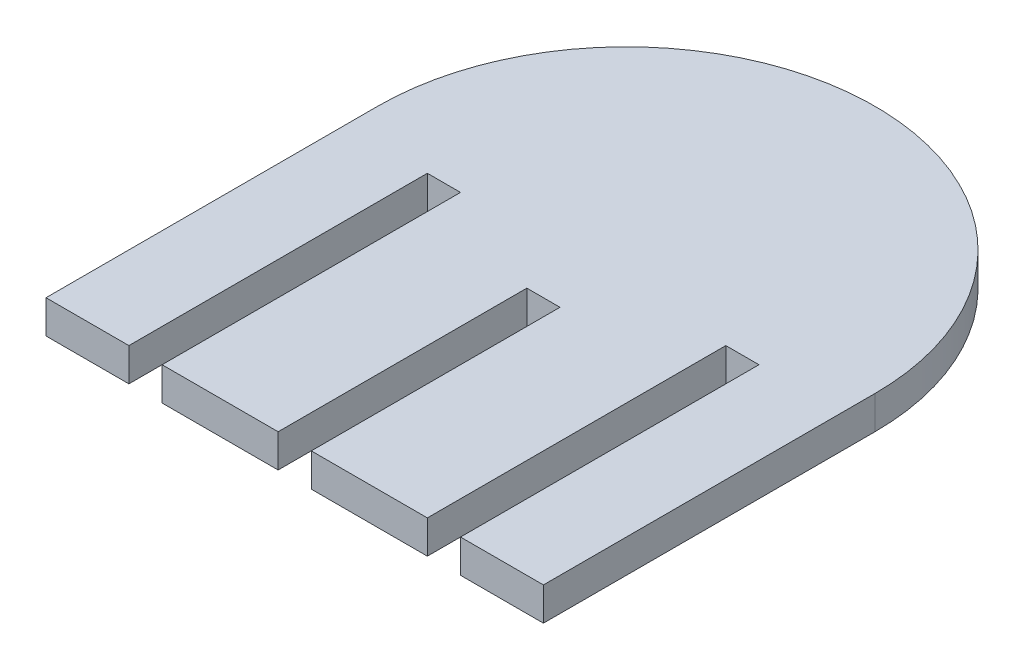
ISO-10303-21;
HEADER;
FILE_DESCRIPTION(('STEP AP214'),'2;1');
FILE_NAME('part.step','',(''),(''),'','','');
FILE_SCHEMA(('AUTOMOTIVE_DESIGN { 1 0 10303 214 1 1 1 1 }'));
ENDSEC;
DATA;
#1=APPLICATION_CONTEXT('core data for automotive mechanical design processes');
#2=APPLICATION_PROTOCOL_DEFINITION('international standard','automotive_design',2000,#1);
#3=PRODUCT_CONTEXT('',#1,'mechanical');
#4=PRODUCT('Part','Part','',(#3));
#5=PRODUCT_RELATED_PRODUCT_CATEGORY('part','',(#4));
#6=PRODUCT_DEFINITION_FORMATION('','',#4);
#7=PRODUCT_DEFINITION_CONTEXT('part definition',#1,'design');
#8=PRODUCT_DEFINITION('design','',#6,#7);
#9=PRODUCT_DEFINITION_SHAPE('','',#8);
#10=(LENGTH_UNIT() NAMED_UNIT(*) SI_UNIT(.MILLI.,.METRE.));
#11=(NAMED_UNIT(*) PLANE_ANGLE_UNIT() SI_UNIT($,.RADIAN.));
#12=(NAMED_UNIT(*) SI_UNIT($,.STERADIAN.) SOLID_ANGLE_UNIT());
#13=UNCERTAINTY_MEASURE_WITH_UNIT(LENGTH_MEASURE(1.E-05),#10,'distance_accuracy_value','');
#14=(GEOMETRIC_REPRESENTATION_CONTEXT(3) GLOBAL_UNCERTAINTY_ASSIGNED_CONTEXT((#13)) GLOBAL_UNIT_ASSIGNED_CONTEXT((#10,
#11,#12)) REPRESENTATION_CONTEXT('',''));
#15=CARTESIAN_POINT('',(0.,0.,0.));
#16=DIRECTION('',(0.,0.,1.));
#17=DIRECTION('',(1.,0.,0.));
#18=AXIS2_PLACEMENT_3D('',#15,#16,#17);
#19=CARTESIAN_POINT('',(-15.,2.,0.));
#20=DIRECTION('',(0.,0.,-1.));
#21=DIRECTION('',(-1.,0.,0.));
#22=AXIS2_PLACEMENT_3D('',#19,#20,#21);
#23=PLANE('',#22);
#24=DIRECTION('',(1.,0.,0.));
#25=VECTOR('',#24,1.);
#26=CARTESIAN_POINT('',(-15.,2.,0.));
#27=LINE('',#26,#25);
#28=CARTESIAN_POINT('',(0.999999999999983,1.99999999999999,0.));
#29=VERTEX_POINT('',#28);
#30=CARTESIAN_POINT('',(8.00000000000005,1.99999999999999,0.));
#31=VERTEX_POINT('',#30);
#32=EDGE_CURVE('E246',#29,#31,#27,.T.);
#33=ORIENTED_EDGE('',*,*,#32,.F.);
#34=DIRECTION('',(0.,1.,0.));
#35=VECTOR('',#34,1.);
#36=CARTESIAN_POINT('',(0.999999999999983,0.,0.));
#37=LINE('',#36,#35);
#38=CARTESIAN_POINT('',(0.999999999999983,0.,0.));
#39=VERTEX_POINT('',#38);
#40=EDGE_CURVE('E154',#39,#29,#37,.T.);
#41=ORIENTED_EDGE('',*,*,#40,.F.);
#42=DIRECTION('',(1.,0.,0.));
#43=VECTOR('',#42,1.);
#44=CARTESIAN_POINT('',(-15.,0.,0.));
#45=LINE('',#44,#43);
#46=CARTESIAN_POINT('',(8.00000000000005,0.,0.));
#47=VERTEX_POINT('',#46);
#48=EDGE_CURVE('E257',#39,#47,#45,.T.);
#49=ORIENTED_EDGE('',*,*,#48,.T.);
#50=DIRECTION('',(0.,-1.,0.));
#51=VECTOR('',#50,1.);
#52=CARTESIAN_POINT('',(8.00000000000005,0.,0.));
#53=LINE('',#52,#51);
#54=EDGE_CURVE('E193',#31,#47,#53,.T.);
#55=ORIENTED_EDGE('',*,*,#54,.F.);
#56=EDGE_LOOP('',(#33,#41,#49,#55));
#57=FACE_BOUND('',#56,.T.);
#58=ADVANCED_FACE('F35',(#57),#23,.F.);
#59=CARTESIAN_POINT('',(-8.00000000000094,0.,0.));
#60=VERTEX_POINT('',#59);
#61=CARTESIAN_POINT('',(-1.00000000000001,0.,0.));
#62=VERTEX_POINT('',#61);
#63=EDGE_CURVE('E256',#60,#62,#45,.T.);
#64=ORIENTED_EDGE('',*,*,#63,.T.);
#65=DIRECTION('',(0.,-1.,0.));
#66=VECTOR('',#65,1.);
#67=CARTESIAN_POINT('',(-1.00000000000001,0.,0.));
#68=LINE('',#67,#66);
#69=CARTESIAN_POINT('',(-1.00000000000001,1.99999999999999,0.));
#70=VERTEX_POINT('',#69);
#71=EDGE_CURVE('E166',#70,#62,#68,.T.);
#72=ORIENTED_EDGE('',*,*,#71,.F.);
#73=CARTESIAN_POINT('',(-8.00000000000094,2.,0.));
#74=VERTEX_POINT('',#73);
#75=EDGE_CURVE('E245',#74,#70,#27,.T.);
#76=ORIENTED_EDGE('',*,*,#75,.F.);
#77=DIRECTION('',(0.,1.,0.));
#78=VECTOR('',#77,1.);
#79=CARTESIAN_POINT('',(-8.00000000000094,0.,0.));
#80=LINE('',#79,#78);
#81=EDGE_CURVE('E178',#60,#74,#80,.T.);
#82=ORIENTED_EDGE('',*,*,#81,.F.);
#83=EDGE_LOOP('',(#64,#72,#76,#82));
#84=FACE_BOUND('',#83,.T.);
#85=ADVANCED_FACE('F297',(#84),#23,.F.);
#86=CARTESIAN_POINT('',(10.,1.99999999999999,0.));
#87=VERTEX_POINT('',#86);
#88=CARTESIAN_POINT('',(15.,2.,0.));
#89=VERTEX_POINT('',#88);
#90=EDGE_CURVE('E240',#87,#89,#27,.T.);
#91=ORIENTED_EDGE('',*,*,#90,.F.);
#92=DIRECTION('',(0.,1.,0.));
#93=VECTOR('',#92,1.);
#94=CARTESIAN_POINT('',(10.,0.,0.));
#95=LINE('',#94,#93);
#96=CARTESIAN_POINT('',(10.,0.,0.));
#97=VERTEX_POINT('',#96);
#98=EDGE_CURVE('E185',#97,#87,#95,.T.);
#99=ORIENTED_EDGE('',*,*,#98,.F.);
#100=CARTESIAN_POINT('',(15.,0.,0.));
#101=VERTEX_POINT('',#100);
#102=EDGE_CURVE('E253',#97,#101,#45,.T.);
#103=ORIENTED_EDGE('',*,*,#102,.T.);
#104=DIRECTION('',(0.,-1.,0.));
#105=VECTOR('',#104,1.);
#106=CARTESIAN_POINT('',(15.,2.,0.));
#107=LINE('',#106,#105);
#108=EDGE_CURVE('E244',#89,#101,#107,.T.);
#109=ORIENTED_EDGE('',*,*,#108,.F.);
#110=EDGE_LOOP('',(#91,#99,#103,#109));
#111=FACE_BOUND('',#110,.T.);
#112=ADVANCED_FACE('F317',(#111),#23,.F.);
#113=CARTESIAN_POINT('',(15.,2.,0.));
#114=DIRECTION('',(-1.,0.,0.));
#115=DIRECTION('',(0.,0.,1.));
#116=AXIS2_PLACEMENT_3D('',#113,#114,#115);
#117=PLANE('',#116);
#118=DIRECTION('',(0.,0.,-1.));
#119=VECTOR('',#118,1.);
#120=CARTESIAN_POINT('',(15.,0.,0.));
#121=LINE('',#120,#119);
#122=CARTESIAN_POINT('',(15.,0.,-20.));
#123=VERTEX_POINT('',#122);
#124=EDGE_CURVE('E201',#101,#123,#121,.T.);
#125=ORIENTED_EDGE('',*,*,#124,.T.);
#126=DIRECTION('',(0.,-1.,0.));
#127=VECTOR('',#126,1.);
#128=CARTESIAN_POINT('',(15.,2.,-20.));
#129=LINE('',#128,#127);
#130=CARTESIAN_POINT('',(15.,2.,-20.));
#131=VERTEX_POINT('',#130);
#132=EDGE_CURVE('E11',#131,#123,#129,.T.);
#133=ORIENTED_EDGE('',*,*,#132,.F.);
#134=DIRECTION('',(0.,0.,-1.));
#135=VECTOR('',#134,1.);
#136=CARTESIAN_POINT('',(15.,2.,0.));
#137=LINE('',#136,#135);
#138=EDGE_CURVE('E232',#89,#131,#137,.T.);
#139=ORIENTED_EDGE('',*,*,#138,.F.);
#140=ORIENTED_EDGE('',*,*,#108,.T.);
#141=EDGE_LOOP('',(#125,#133,#139,#140));
#142=FACE_BOUND('',#141,.T.);
#143=ADVANCED_FACE('F37',(#142),#117,.F.);
#144=CARTESIAN_POINT('',(0.,2.,-20.));
#145=DIRECTION('',(0.,-1.,0.));
#146=DIRECTION('',(0.,0.,-1.));
#147=AXIS2_PLACEMENT_3D('',#144,#145,#146);
#148=CYLINDRICAL_SURFACE('',#147,15.);
#149=CARTESIAN_POINT('',(0.,0.,-20.));
#150=DIRECTION('',(0.,1.,0.));
#151=DIRECTION('',(0.,0.,-1.));
#152=AXIS2_PLACEMENT_3D('',#149,#150,#151);
#153=CIRCLE('',#152,15.);
#154=CARTESIAN_POINT('',(-15.,0.,-20.));
#155=VERTEX_POINT('',#154);
#156=EDGE_CURVE('E249',#123,#155,#153,.T.);
#157=ORIENTED_EDGE('',*,*,#156,.T.);
#158=DIRECTION('',(0.,-1.,0.));
#159=VECTOR('',#158,1.);
#160=CARTESIAN_POINT('',(-15.,2.,-20.));
#161=LINE('',#160,#159);
#162=CARTESIAN_POINT('',(-15.,2.,-20.));
#163=VERTEX_POINT('',#162);
#164=EDGE_CURVE('E43',#163,#155,#161,.T.);
#165=ORIENTED_EDGE('',*,*,#164,.F.);
#166=CARTESIAN_POINT('',(0.,2.,-20.));
#167=DIRECTION('',(0.,1.,0.));
#168=DIRECTION('',(0.,0.,-1.));
#169=AXIS2_PLACEMENT_3D('',#166,#167,#168);
#170=CIRCLE('',#169,15.);
#171=EDGE_CURVE('E235',#131,#163,#170,.T.);
#172=ORIENTED_EDGE('',*,*,#171,.F.);
#173=ORIENTED_EDGE('',*,*,#132,.T.);
#174=EDGE_LOOP('',(#157,#165,#172,#173));
#175=FACE_BOUND('',#174,.T.);
#176=ADVANCED_FACE('F284',(#175),#148,.T.);
#177=CARTESIAN_POINT('',(-15.,2.,0.));
#178=DIRECTION('',(1.,0.,0.));
#179=DIRECTION('',(0.,0.,-1.));
#180=AXIS2_PLACEMENT_3D('',#177,#178,#179);
#181=PLANE('',#180);
#182=DIRECTION('',(0.,0.,1.));
#183=VECTOR('',#182,1.);
#184=CARTESIAN_POINT('',(-15.,0.,0.));
#185=LINE('',#184,#183);
#186=CARTESIAN_POINT('',(-15.,0.,0.));
#187=VERTEX_POINT('',#186);
#188=EDGE_CURVE('E251',#155,#187,#185,.T.);
#189=ORIENTED_EDGE('',*,*,#188,.T.);
#190=DIRECTION('',(0.,-1.,0.));
#191=VECTOR('',#190,1.);
#192=CARTESIAN_POINT('',(-15.,2.,0.));
#193=LINE('',#192,#191);
#194=CARTESIAN_POINT('',(-15.,2.,0.));
#195=VERTEX_POINT('',#194);
#196=EDGE_CURVE('E260',#195,#187,#193,.T.);
#197=ORIENTED_EDGE('',*,*,#196,.F.);
#198=DIRECTION('',(0.,0.,1.));
#199=VECTOR('',#198,1.);
#200=CARTESIAN_POINT('',(-15.,2.,0.));
#201=LINE('',#200,#199);
#202=EDGE_CURVE('E238',#163,#195,#201,.T.);
#203=ORIENTED_EDGE('',*,*,#202,.F.);
#204=ORIENTED_EDGE('',*,*,#164,.T.);
#205=EDGE_LOOP('',(#189,#197,#203,#204));
#206=FACE_BOUND('',#205,.T.);
#207=ADVANCED_FACE('F267',(#206),#181,.F.);
#208=CARTESIAN_POINT('',(-10.0000000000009,0.,0.));
#209=VERTEX_POINT('',#208);
#210=EDGE_CURVE('E236',#187,#209,#45,.T.);
#211=ORIENTED_EDGE('',*,*,#210,.T.);
#212=DIRECTION('',(0.,-1.,0.));
#213=VECTOR('',#212,1.);
#214=CARTESIAN_POINT('',(-10.0000000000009,0.,0.));
#215=LINE('',#214,#213);
#216=CARTESIAN_POINT('',(-10.0000000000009,2.,0.));
#217=VERTEX_POINT('',#216);
#218=EDGE_CURVE('E213',#217,#209,#215,.T.);
#219=ORIENTED_EDGE('',*,*,#218,.F.);
#220=EDGE_CURVE('E241',#195,#217,#27,.T.);
#221=ORIENTED_EDGE('',*,*,#220,.F.);
#222=ORIENTED_EDGE('',*,*,#196,.T.);
#223=EDGE_LOOP('',(#211,#219,#221,#222));
#224=FACE_BOUND('',#223,.T.);
#225=ADVANCED_FACE('F278',(#224),#23,.F.);
#226=CARTESIAN_POINT('',(0.,2.,-20.));
#227=DIRECTION('',(0.,-1.,0.));
#228=DIRECTION('',(0.,0.,-1.));
#229=AXIS2_PLACEMENT_3D('',#226,#227,#228);
#230=PLANE('',#229);
#231=DIRECTION('',(-1.,0.,0.));
#232=VECTOR('',#231,1.);
#233=CARTESIAN_POINT('',(0.999999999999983,1.99999999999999,-15.));
#234=LINE('',#233,#232);
#235=CARTESIAN_POINT('',(0.999999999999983,1.99999999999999,-15.));
#236=VERTEX_POINT('',#235);
#237=CARTESIAN_POINT('',(-1.00000000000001,1.99999999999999,-15.));
#238=VERTEX_POINT('',#237);
#239=EDGE_CURVE('E162',#236,#238,#234,.T.);
#240=ORIENTED_EDGE('',*,*,#239,.F.);
#241=DIRECTION('',(0.,0.,1.));
#242=VECTOR('',#241,1.);
#243=CARTESIAN_POINT('',(0.999999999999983,1.99999999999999,-15.));
#244=LINE('',#243,#242);
#245=EDGE_CURVE('E149',#236,#29,#244,.T.);
#246=ORIENTED_EDGE('',*,*,#245,.T.);
#247=ORIENTED_EDGE('',*,*,#32,.T.);
#248=DIRECTION('',(0.,0.,1.));
#249=VECTOR('',#248,1.);
#250=CARTESIAN_POINT('',(8.00000000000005,1.99999999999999,-18.));
#251=LINE('',#250,#249);
#252=CARTESIAN_POINT('',(8.00000000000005,1.99999999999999,-18.));
#253=VERTEX_POINT('',#252);
#254=EDGE_CURVE('E198',#253,#31,#251,.T.);
#255=ORIENTED_EDGE('',*,*,#254,.F.);
#256=DIRECTION('',(-1.,0.,0.));
#257=VECTOR('',#256,1.);
#258=CARTESIAN_POINT('',(8.00000000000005,1.99999999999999,-18.));
#259=LINE('',#258,#257);
#260=CARTESIAN_POINT('',(10.,1.99999999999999,-18.));
#261=VERTEX_POINT('',#260);
#262=EDGE_CURVE('E190',#261,#253,#259,.T.);
#263=ORIENTED_EDGE('',*,*,#262,.F.);
#264=DIRECTION('',(0.,0.,1.));
#265=VECTOR('',#264,1.);
#266=CARTESIAN_POINT('',(10.,1.99999999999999,-18.));
#267=LINE('',#266,#265);
#268=EDGE_CURVE('E202',#261,#87,#267,.T.);
#269=ORIENTED_EDGE('',*,*,#268,.T.);
#270=ORIENTED_EDGE('',*,*,#90,.T.);
#271=ORIENTED_EDGE('',*,*,#138,.T.);
#272=ORIENTED_EDGE('',*,*,#171,.T.);
#273=ORIENTED_EDGE('',*,*,#202,.T.);
#274=ORIENTED_EDGE('',*,*,#220,.T.);
#275=DIRECTION('',(0.,0.,1.));
#276=VECTOR('',#275,1.);
#277=CARTESIAN_POINT('',(-10.0000000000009,2.,-18.));
#278=LINE('',#277,#276);
#279=CARTESIAN_POINT('',(-10.0000000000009,2.,-18.));
#280=VERTEX_POINT('',#279);
#281=EDGE_CURVE('E228',#280,#217,#278,.T.);
#282=ORIENTED_EDGE('',*,*,#281,.F.);
#283=DIRECTION('',(-1.,0.,0.));
#284=VECTOR('',#283,1.);
#285=CARTESIAN_POINT('',(-8.00000000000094,2.,-18.));
#286=LINE('',#285,#284);
#287=CARTESIAN_POINT('',(-8.00000000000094,2.,-18.));
#288=VERTEX_POINT('',#287);
#289=EDGE_CURVE('E212',#288,#280,#286,.T.);
#290=ORIENTED_EDGE('',*,*,#289,.F.);
#291=DIRECTION('',(0.,0.,1.));
#292=VECTOR('',#291,1.);
#293=CARTESIAN_POINT('',(-8.00000000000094,2.,-18.));
#294=LINE('',#293,#292);
#295=EDGE_CURVE('E221',#288,#74,#294,.T.);
#296=ORIENTED_EDGE('',*,*,#295,.T.);
#297=ORIENTED_EDGE('',*,*,#75,.T.);
#298=DIRECTION('',(0.,0.,1.));
#299=VECTOR('',#298,1.);
#300=CARTESIAN_POINT('',(-1.00000000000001,1.99999999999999,-15.));
#301=LINE('',#300,#299);
#302=EDGE_CURVE('E158',#238,#70,#301,.T.);
#303=ORIENTED_EDGE('',*,*,#302,.F.);
#304=EDGE_LOOP('',(#240,#246,#247,#255,#263,#269,#270,#271,#272,#273,#274,#282,#290,#296,#297,#303));
#305=FACE_BOUND('',#304,.T.);
#306=ADVANCED_FACE('F168',(#305),#230,.F.);
#307=CARTESIAN_POINT('',(0.,0.,-20.));
#308=DIRECTION('',(0.,-1.,0.));
#309=DIRECTION('',(0.,0.,-1.));
#310=AXIS2_PLACEMENT_3D('',#307,#308,#309);
#311=PLANE('',#310);
#312=DIRECTION('',(0.,0.,1.));
#313=VECTOR('',#312,1.);
#314=CARTESIAN_POINT('',(0.999999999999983,0.,-15.));
#315=LINE('',#314,#313);
#316=CARTESIAN_POINT('',(0.999999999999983,0.,-15.));
#317=VERTEX_POINT('',#316);
#318=EDGE_CURVE('E176',#317,#39,#315,.T.);
#319=ORIENTED_EDGE('',*,*,#318,.F.);
#320=DIRECTION('',(1.,0.,0.));
#321=VECTOR('',#320,1.);
#322=CARTESIAN_POINT('',(0.999999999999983,0.,-15.));
#323=LINE('',#322,#321);
#324=CARTESIAN_POINT('',(-1.00000000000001,0.,-15.));
#325=VERTEX_POINT('',#324);
#326=EDGE_CURVE('E159',#325,#317,#323,.T.);
#327=ORIENTED_EDGE('',*,*,#326,.F.);
#328=DIRECTION('',(0.,0.,1.));
#329=VECTOR('',#328,1.);
#330=CARTESIAN_POINT('',(-1.00000000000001,0.,-15.));
#331=LINE('',#330,#329);
#332=EDGE_CURVE('E179',#325,#62,#331,.T.);
#333=ORIENTED_EDGE('',*,*,#332,.T.);
#334=ORIENTED_EDGE('',*,*,#63,.F.);
#335=DIRECTION('',(0.,0.,1.));
#336=VECTOR('',#335,1.);
#337=CARTESIAN_POINT('',(-8.00000000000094,0.,-18.));
#338=LINE('',#337,#336);
#339=CARTESIAN_POINT('',(-8.00000000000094,0.,-18.));
#340=VERTEX_POINT('',#339);
#341=EDGE_CURVE('E196',#340,#60,#338,.T.);
#342=ORIENTED_EDGE('',*,*,#341,.F.);
#343=DIRECTION('',(1.,0.,0.));
#344=VECTOR('',#343,1.);
#345=CARTESIAN_POINT('',(-8.00000000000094,0.,-18.));
#346=LINE('',#345,#344);
#347=CARTESIAN_POINT('',(-10.0000000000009,0.,-18.));
#348=VERTEX_POINT('',#347);
#349=EDGE_CURVE('E218',#348,#340,#346,.T.);
#350=ORIENTED_EDGE('',*,*,#349,.F.);
#351=DIRECTION('',(0.,0.,1.));
#352=VECTOR('',#351,1.);
#353=CARTESIAN_POINT('',(-10.0000000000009,0.,-18.));
#354=LINE('',#353,#352);
#355=EDGE_CURVE('E225',#348,#209,#354,.T.);
#356=ORIENTED_EDGE('',*,*,#355,.T.);
#357=ORIENTED_EDGE('',*,*,#210,.F.);
#358=ORIENTED_EDGE('',*,*,#188,.F.);
#359=ORIENTED_EDGE('',*,*,#156,.F.);
#360=ORIENTED_EDGE('',*,*,#124,.F.);
#361=ORIENTED_EDGE('',*,*,#102,.F.);
#362=DIRECTION('',(0.,0.,1.));
#363=VECTOR('',#362,1.);
#364=CARTESIAN_POINT('',(10.,0.,-18.));
#365=LINE('',#364,#363);
#366=CARTESIAN_POINT('',(10.,0.,-18.));
#367=VERTEX_POINT('',#366);
#368=EDGE_CURVE('E205',#367,#97,#365,.T.);
#369=ORIENTED_EDGE('',*,*,#368,.F.);
#370=DIRECTION('',(1.,0.,0.));
#371=VECTOR('',#370,1.);
#372=CARTESIAN_POINT('',(8.00000000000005,0.,-18.));
#373=LINE('',#372,#371);
#374=CARTESIAN_POINT('',(8.00000000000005,0.,-18.));
#375=VERTEX_POINT('',#374);
#376=EDGE_CURVE('E184',#375,#367,#373,.T.);
#377=ORIENTED_EDGE('',*,*,#376,.F.);
#378=DIRECTION('',(0.,0.,1.));
#379=VECTOR('',#378,1.);
#380=CARTESIAN_POINT('',(8.00000000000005,0.,-18.));
#381=LINE('',#380,#379);
#382=EDGE_CURVE('E192',#375,#47,#381,.T.);
#383=ORIENTED_EDGE('',*,*,#382,.T.);
#384=ORIENTED_EDGE('',*,*,#48,.F.);
#385=EDGE_LOOP('',(#319,#327,#333,#334,#342,#350,#356,#357,#358,#359,#360,#361,#369,#377,#383,#384));
#386=FACE_BOUND('',#385,.T.);
#387=ADVANCED_FACE('F272',(#386),#311,.T.);
#388=CARTESIAN_POINT('',(-8.00000000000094,0.,-18.));
#389=DIRECTION('',(1.,0.,0.));
#390=DIRECTION('',(0.,0.,-1.));
#391=AXIS2_PLACEMENT_3D('',#388,#389,#390);
#392=PLANE('',#391);
#393=ORIENTED_EDGE('',*,*,#81,.T.);
#394=ORIENTED_EDGE('',*,*,#295,.F.);
#395=DIRECTION('',(0.,1.,0.));
#396=VECTOR('',#395,1.);
#397=CARTESIAN_POINT('',(-8.00000000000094,0.,-18.));
#398=LINE('',#397,#396);
#399=EDGE_CURVE('E209',#340,#288,#398,.T.);
#400=ORIENTED_EDGE('',*,*,#399,.F.);
#401=ORIENTED_EDGE('',*,*,#341,.T.);
#402=EDGE_LOOP('',(#393,#394,#400,#401));
#403=FACE_BOUND('',#402,.T.);
#404=ADVANCED_FACE('F332',(#403),#392,.F.);
#405=CARTESIAN_POINT('',(-10.0000000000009,0.,-18.));
#406=DIRECTION('',(-1.,0.,0.));
#407=DIRECTION('',(0.,0.,1.));
#408=AXIS2_PLACEMENT_3D('',#405,#406,#407);
#409=PLANE('',#408);
#410=ORIENTED_EDGE('',*,*,#218,.T.);
#411=ORIENTED_EDGE('',*,*,#355,.F.);
#412=DIRECTION('',(0.,-1.,0.));
#413=VECTOR('',#412,1.);
#414=CARTESIAN_POINT('',(-10.0000000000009,0.,-18.));
#415=LINE('',#414,#413);
#416=EDGE_CURVE('E216',#280,#348,#415,.T.);
#417=ORIENTED_EDGE('',*,*,#416,.F.);
#418=ORIENTED_EDGE('',*,*,#281,.T.);
#419=EDGE_LOOP('',(#410,#411,#417,#418));
#420=FACE_BOUND('',#419,.T.);
#421=ADVANCED_FACE('F336',(#420),#409,.F.);
#422=CARTESIAN_POINT('',(0.,0.,-18.));
#423=DIRECTION('',(0.,0.,1.));
#424=DIRECTION('',(1.,0.,0.));
#425=AXIS2_PLACEMENT_3D('',#422,#423,#424);
#426=PLANE('',#425);
#427=ORIENTED_EDGE('',*,*,#399,.T.);
#428=ORIENTED_EDGE('',*,*,#289,.T.);
#429=ORIENTED_EDGE('',*,*,#416,.T.);
#430=ORIENTED_EDGE('',*,*,#349,.T.);
#431=EDGE_LOOP('',(#427,#428,#429,#430));
#432=FACE_BOUND('',#431,.T.);
#433=ADVANCED_FACE('F334',(#432),#426,.T.);
#434=CARTESIAN_POINT('',(8.00000000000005,0.,-18.));
#435=DIRECTION('',(-1.,0.,0.));
#436=DIRECTION('',(0.,0.,1.));
#437=AXIS2_PLACEMENT_3D('',#434,#435,#436);
#438=PLANE('',#437);
#439=ORIENTED_EDGE('',*,*,#54,.T.);
#440=ORIENTED_EDGE('',*,*,#382,.F.);
#441=DIRECTION('',(0.,-1.,0.));
#442=VECTOR('',#441,1.);
#443=CARTESIAN_POINT('',(8.00000000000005,0.,-18.));
#444=LINE('',#443,#442);
#445=EDGE_CURVE('E58',#253,#375,#444,.T.);
#446=ORIENTED_EDGE('',*,*,#445,.F.);
#447=ORIENTED_EDGE('',*,*,#254,.T.);
#448=EDGE_LOOP('',(#439,#440,#446,#447));
#449=FACE_BOUND('',#448,.T.);
#450=ADVANCED_FACE('F343',(#449),#438,.F.);
#451=CARTESIAN_POINT('',(10.,0.,-18.));
#452=DIRECTION('',(1.,0.,0.));
#453=DIRECTION('',(0.,0.,-1.));
#454=AXIS2_PLACEMENT_3D('',#451,#452,#453);
#455=PLANE('',#454);
#456=ORIENTED_EDGE('',*,*,#98,.T.);
#457=ORIENTED_EDGE('',*,*,#268,.F.);
#458=DIRECTION('',(0.,1.,0.));
#459=VECTOR('',#458,1.);
#460=CARTESIAN_POINT('',(10.,0.,-18.));
#461=LINE('',#460,#459);
#462=EDGE_CURVE('E187',#367,#261,#461,.T.);
#463=ORIENTED_EDGE('',*,*,#462,.F.);
#464=ORIENTED_EDGE('',*,*,#368,.T.);
#465=EDGE_LOOP('',(#456,#457,#463,#464));
#466=FACE_BOUND('',#465,.T.);
#467=ADVANCED_FACE('F379',(#466),#455,.F.);
#468=CARTESIAN_POINT('',(0.,0.,-18.));
#469=DIRECTION('',(0.,0.,-1.));
#470=DIRECTION('',(-1.,0.,0.));
#471=AXIS2_PLACEMENT_3D('',#468,#469,#470);
#472=PLANE('',#471);
#473=ORIENTED_EDGE('',*,*,#445,.T.);
#474=ORIENTED_EDGE('',*,*,#376,.T.);
#475=ORIENTED_EDGE('',*,*,#462,.T.);
#476=ORIENTED_EDGE('',*,*,#262,.T.);
#477=EDGE_LOOP('',(#473,#474,#475,#476));
#478=FACE_BOUND('',#477,.T.);
#479=ADVANCED_FACE('F309',(#478),#472,.F.);
#480=CARTESIAN_POINT('',(0.999999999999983,0.,-15.));
#481=DIRECTION('',(1.,0.,0.));
#482=DIRECTION('',(0.,0.,-1.));
#483=AXIS2_PLACEMENT_3D('',#480,#481,#482);
#484=PLANE('',#483);
#485=ORIENTED_EDGE('',*,*,#40,.T.);
#486=ORIENTED_EDGE('',*,*,#245,.F.);
#487=DIRECTION('',(0.,1.,0.));
#488=VECTOR('',#487,1.);
#489=CARTESIAN_POINT('',(0.999999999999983,0.,-15.));
#490=LINE('',#489,#488);
#491=EDGE_CURVE('E152',#317,#236,#490,.T.);
#492=ORIENTED_EDGE('',*,*,#491,.F.);
#493=ORIENTED_EDGE('',*,*,#318,.T.);
#494=EDGE_LOOP('',(#485,#486,#492,#493));
#495=FACE_BOUND('',#494,.T.);
#496=ADVANCED_FACE('F151',(#495),#484,.F.);
#497=CARTESIAN_POINT('',(-1.00000000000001,0.,-15.));
#498=DIRECTION('',(-1.,0.,0.));
#499=DIRECTION('',(0.,0.,1.));
#500=AXIS2_PLACEMENT_3D('',#497,#498,#499);
#501=PLANE('',#500);
#502=ORIENTED_EDGE('',*,*,#71,.T.);
#503=ORIENTED_EDGE('',*,*,#332,.F.);
#504=DIRECTION('',(0.,-1.,0.));
#505=VECTOR('',#504,1.);
#506=CARTESIAN_POINT('',(-1.00000000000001,0.,-15.));
#507=LINE('',#506,#505);
#508=EDGE_CURVE('E50',#238,#325,#507,.T.);
#509=ORIENTED_EDGE('',*,*,#508,.F.);
#510=ORIENTED_EDGE('',*,*,#302,.T.);
#511=EDGE_LOOP('',(#502,#503,#509,#510));
#512=FACE_BOUND('',#511,.T.);
#513=ADVANCED_FACE('F301',(#512),#501,.F.);
#514=CARTESIAN_POINT('',(0.,0.,-15.));
#515=DIRECTION('',(0.,0.,1.));
#516=DIRECTION('',(1.,0.,0.));
#517=AXIS2_PLACEMENT_3D('',#514,#515,#516);
#518=PLANE('',#517);
#519=ORIENTED_EDGE('',*,*,#491,.T.);
#520=ORIENTED_EDGE('',*,*,#239,.T.);
#521=ORIENTED_EDGE('',*,*,#508,.T.);
#522=ORIENTED_EDGE('',*,*,#326,.T.);
#523=EDGE_LOOP('',(#519,#520,#521,#522));
#524=FACE_BOUND('',#523,.T.);
#525=ADVANCED_FACE('F161',(#524),#518,.T.);
#526=CLOSED_SHELL('',(#58,#85,#112,#143,#176,#207,#225,#306,#387,#404,#421,#433,#450,#467,#479,
#496,#513,#525));
#527=MANIFOLD_SOLID_BREP('B2',#526);
#528=ADVANCED_BREP_SHAPE_REPRESENTATION('',(#18,#527),#14);
#529=SHAPE_DEFINITION_REPRESENTATION(#9,#528);
ENDSEC;
END-ISO-10303-21;
